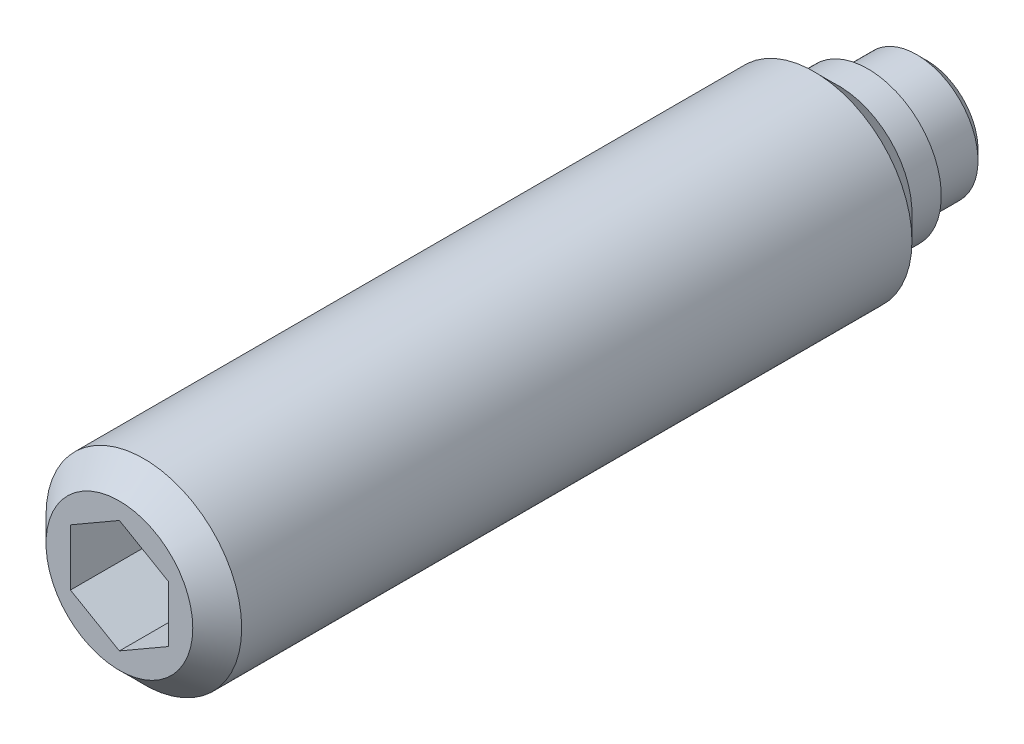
ISO-10303-21;
HEADER;
FILE_DESCRIPTION(('STEP AP214'),'2;1');
FILE_NAME('part.step','',(''),(''),'','','');
FILE_SCHEMA(('AUTOMOTIVE_DESIGN { 1 0 10303 214 1 1 1 1 }'));
ENDSEC;
DATA;
#1=APPLICATION_CONTEXT('core data for automotive mechanical design processes');
#2=APPLICATION_PROTOCOL_DEFINITION('international standard','automotive_design',2000,#1);
#3=PRODUCT_CONTEXT('',#1,'mechanical');
#4=PRODUCT('Part','Part','',(#3));
#5=PRODUCT_RELATED_PRODUCT_CATEGORY('part','',(#4));
#6=PRODUCT_DEFINITION_FORMATION('','',#4);
#7=PRODUCT_DEFINITION_CONTEXT('part definition',#1,'design');
#8=PRODUCT_DEFINITION('design','',#6,#7);
#9=PRODUCT_DEFINITION_SHAPE('','',#8);
#10=(LENGTH_UNIT() NAMED_UNIT(*) SI_UNIT(.MILLI.,.METRE.));
#11=(NAMED_UNIT(*) PLANE_ANGLE_UNIT() SI_UNIT($,.RADIAN.));
#12=(NAMED_UNIT(*) SI_UNIT($,.STERADIAN.) SOLID_ANGLE_UNIT());
#13=UNCERTAINTY_MEASURE_WITH_UNIT(LENGTH_MEASURE(1.E-05),#10,'distance_accuracy_value','');
#14=(GEOMETRIC_REPRESENTATION_CONTEXT(3) GLOBAL_UNCERTAINTY_ASSIGNED_CONTEXT((#13)) GLOBAL_UNIT_ASSIGNED_CONTEXT((#10,
#11,#12)) REPRESENTATION_CONTEXT('',''));
#15=CARTESIAN_POINT('',(0.,0.,0.));
#16=DIRECTION('',(0.,0.,1.));
#17=DIRECTION('',(1.,0.,0.));
#18=AXIS2_PLACEMENT_3D('',#15,#16,#17);
#19=CARTESIAN_POINT('',(0.,0.,1.2));
#20=DIRECTION('',(0.,0.,-1.));
#21=DIRECTION('',(-1.,0.,0.));
#22=AXIS2_PLACEMENT_3D('',#19,#20,#21);
#23=CYLINDRICAL_SURFACE('',#22,2.);
#24=CARTESIAN_POINT('',(0.,0.,2.3));
#25=DIRECTION('',(0.,0.,-1.));
#26=DIRECTION('',(-1.,0.,0.));
#27=AXIS2_PLACEMENT_3D('',#24,#25,#26);
#28=CIRCLE('',#27,2.);
#29=CARTESIAN_POINT('',(-2.,0.,2.3));
#30=VERTEX_POINT('',#29);
#31=EDGE_CURVE('E9',#30,#30,#28,.T.);
#32=ORIENTED_EDGE('',*,*,#31,.F.);
#33=EDGE_LOOP('',(#32));
#34=FACE_BOUND('',#33,.T.);
#35=CARTESIAN_POINT('',(0.,0.,16.));
#36=DIRECTION('',(0.,0.,1.));
#37=DIRECTION('',(1.,0.,0.));
#38=AXIS2_PLACEMENT_3D('',#35,#36,#37);
#39=CIRCLE('',#38,2.);
#40=CARTESIAN_POINT('',(2.,0.,16.));
#41=VERTEX_POINT('',#40);
#42=EDGE_CURVE('E115',#41,#41,#39,.T.);
#43=ORIENTED_EDGE('',*,*,#42,.F.);
#44=EDGE_LOOP('',(#43));
#45=FACE_BOUND('',#44,.T.);
#46=ADVANCED_FACE('F14',(#34,#45),#23,.T.);
#47=CARTESIAN_POINT('',(0.,0.,2.3));
#48=DIRECTION('',(0.,0.,1.));
#49=DIRECTION('',(1.,0.,0.));
#50=AXIS2_PLACEMENT_3D('',#47,#48,#49);
#51=CONICAL_SURFACE('',#50,2.,0.785398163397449);
#52=ORIENTED_EDGE('',*,*,#31,.T.);
#53=EDGE_LOOP('',(#52));
#54=FACE_BOUND('',#53,.T.);
#55=CARTESIAN_POINT('',(0.,0.,1.8));
#56=DIRECTION('',(0.,0.,-1.));
#57=DIRECTION('',(-1.,0.,0.));
#58=AXIS2_PLACEMENT_3D('',#55,#56,#57);
#59=CIRCLE('',#58,1.5);
#60=CARTESIAN_POINT('',(-1.5,0.,1.8));
#61=VERTEX_POINT('',#60);
#62=EDGE_CURVE('E21',#61,#61,#59,.T.);
#63=ORIENTED_EDGE('',*,*,#62,.F.);
#64=EDGE_LOOP('',(#63));
#65=FACE_BOUND('',#64,.T.);
#66=ADVANCED_FACE('F142',(#54,#65),#51,.T.);
#67=CARTESIAN_POINT('',(0.,0.,1.2));
#68=DIRECTION('',(0.,0.,-1.));
#69=DIRECTION('',(-1.,0.,0.));
#70=AXIS2_PLACEMENT_3D('',#67,#68,#69);
#71=CYLINDRICAL_SURFACE('',#70,1.5);
#72=CARTESIAN_POINT('',(0.,0.,1.2));
#73=DIRECTION('',(0.,0.,-1.));
#74=DIRECTION('',(-1.,0.,0.));
#75=AXIS2_PLACEMENT_3D('',#72,#73,#74);
#76=CIRCLE('',#75,1.5);
#77=CARTESIAN_POINT('',(-1.5,0.,1.2));
#78=VERTEX_POINT('',#77);
#79=EDGE_CURVE('E135',#78,#78,#76,.T.);
#80=ORIENTED_EDGE('',*,*,#79,.F.);
#81=EDGE_LOOP('',(#80));
#82=FACE_BOUND('',#81,.T.);
#83=ORIENTED_EDGE('',*,*,#62,.T.);
#84=EDGE_LOOP('',(#83));
#85=FACE_BOUND('',#84,.T.);
#86=ADVANCED_FACE('F140',(#82,#85),#71,.T.);
#87=CARTESIAN_POINT('',(0.,1.5,1.2));
#88=DIRECTION('',(0.,0.,1.));
#89=DIRECTION('',(1.,0.,0.));
#90=AXIS2_PLACEMENT_3D('',#87,#88,#89);
#91=PLANE('',#90);
#92=CARTESIAN_POINT('',(0.,0.,1.2));
#93=DIRECTION('',(0.,0.,-1.));
#94=DIRECTION('',(-1.,0.,0.));
#95=AXIS2_PLACEMENT_3D('',#92,#93,#94);
#96=CIRCLE('',#95,1.25);
#97=CARTESIAN_POINT('',(-1.25,0.,1.2));
#98=VERTEX_POINT('',#97);
#99=EDGE_CURVE('E132',#98,#98,#96,.T.);
#100=ORIENTED_EDGE('',*,*,#99,.F.);
#101=EDGE_LOOP('',(#100));
#102=FACE_BOUND('',#101,.T.);
#103=ORIENTED_EDGE('',*,*,#79,.T.);
#104=EDGE_LOOP('',(#103));
#105=FACE_BOUND('',#104,.T.);
#106=ADVANCED_FACE('F150',(#102,#105),#91,.F.);
#107=CARTESIAN_POINT('',(0.,0.,0.));
#108=DIRECTION('',(0.,0.,-1.));
#109=DIRECTION('',(-1.,0.,0.));
#110=AXIS2_PLACEMENT_3D('',#107,#108,#109);
#111=CYLINDRICAL_SURFACE('',#110,1.25);
#112=CARTESIAN_POINT('',(0.,0.,0.2));
#113=DIRECTION('',(0.,0.,-1.));
#114=DIRECTION('',(-1.,0.,0.));
#115=AXIS2_PLACEMENT_3D('',#112,#113,#114);
#116=CIRCLE('',#115,1.25);
#117=CARTESIAN_POINT('',(-1.25,0.,0.2));
#118=VERTEX_POINT('',#117);
#119=EDGE_CURVE('E129',#118,#118,#116,.T.);
#120=ORIENTED_EDGE('',*,*,#119,.F.);
#121=EDGE_LOOP('',(#120));
#122=FACE_BOUND('',#121,.T.);
#123=ORIENTED_EDGE('',*,*,#99,.T.);
#124=EDGE_LOOP('',(#123));
#125=FACE_BOUND('',#124,.T.);
#126=ADVANCED_FACE('F157',(#122,#125),#111,.T.);
#127=CARTESIAN_POINT('',(0.,0.,0.2));
#128=DIRECTION('',(0.,0.,1.));
#129=DIRECTION('',(1.,0.,0.));
#130=AXIS2_PLACEMENT_3D('',#127,#128,#129);
#131=CONICAL_SURFACE('',#130,1.25,0.785398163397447);
#132=CARTESIAN_POINT('',(0.,0.,0.));
#133=DIRECTION('',(0.,0.,-1.));
#134=DIRECTION('',(-1.,0.,0.));
#135=AXIS2_PLACEMENT_3D('',#132,#133,#134);
#136=CIRCLE('',#135,1.05);
#137=CARTESIAN_POINT('',(-1.05,0.,0.));
#138=VERTEX_POINT('',#137);
#139=EDGE_CURVE('E126',#138,#138,#136,.T.);
#140=ORIENTED_EDGE('',*,*,#139,.F.);
#141=EDGE_LOOP('',(#140));
#142=FACE_BOUND('',#141,.T.);
#143=ORIENTED_EDGE('',*,*,#119,.T.);
#144=EDGE_LOOP('',(#143));
#145=FACE_BOUND('',#144,.T.);
#146=ADVANCED_FACE('F161',(#142,#145),#131,.T.);
#147=CARTESIAN_POINT('',(0.,1.05,0.));
#148=DIRECTION('',(0.,0.,1.));
#149=DIRECTION('',(1.,0.,0.));
#150=AXIS2_PLACEMENT_3D('',#147,#148,#149);
#151=PLANE('',#150);
#152=ORIENTED_EDGE('',*,*,#139,.T.);
#153=EDGE_LOOP('',(#152));
#154=FACE_BOUND('',#153,.T.);
#155=ADVANCED_FACE('F165',(#154),#151,.F.);
#156=CARTESIAN_POINT('',(0.,0.,16.5));
#157=DIRECTION('',(0.,0.,1.));
#158=DIRECTION('',(1.,0.,0.));
#159=AXIS2_PLACEMENT_3D('',#156,#157,#158);
#160=PLANE('',#159);
#161=DIRECTION('',(0.866025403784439,-0.5,0.));
#162=VECTOR('',#161,1.);
#163=CARTESIAN_POINT('',(-1.,-0.577350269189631,16.5));
#164=LINE('',#163,#162);
#165=CARTESIAN_POINT('',(-1.,-0.577350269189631,16.5));
#166=VERTEX_POINT('',#165);
#167=CARTESIAN_POINT('',(0.,-1.15470053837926,16.5));
#168=VERTEX_POINT('',#167);
#169=EDGE_CURVE('E28',#166,#168,#164,.T.);
#170=ORIENTED_EDGE('',*,*,#169,.F.);
#171=DIRECTION('',(0.,-1.,0.));
#172=VECTOR('',#171,1.);
#173=CARTESIAN_POINT('',(-1.,0.577350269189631,16.5));
#174=LINE('',#173,#172);
#175=CARTESIAN_POINT('',(-1.,0.577350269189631,16.5));
#176=VERTEX_POINT('',#175);
#177=EDGE_CURVE('E111',#176,#166,#174,.T.);
#178=ORIENTED_EDGE('',*,*,#177,.F.);
#179=DIRECTION('',(-0.866025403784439,-0.5,0.));
#180=VECTOR('',#179,1.);
#181=CARTESIAN_POINT('',(0.,1.15470053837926,16.5));
#182=LINE('',#181,#180);
#183=CARTESIAN_POINT('',(0.,1.15470053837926,16.5));
#184=VERTEX_POINT('',#183);
#185=EDGE_CURVE('E109',#184,#176,#182,.T.);
#186=ORIENTED_EDGE('',*,*,#185,.F.);
#187=DIRECTION('',(-0.866025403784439,0.5,0.));
#188=VECTOR('',#187,1.);
#189=CARTESIAN_POINT('',(1.,0.577350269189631,16.5));
#190=LINE('',#189,#188);
#191=CARTESIAN_POINT('',(1.,0.577350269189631,16.5));
#192=VERTEX_POINT('',#191);
#193=EDGE_CURVE('E76',#192,#184,#190,.T.);
#194=ORIENTED_EDGE('',*,*,#193,.F.);
#195=DIRECTION('',(0.,1.,0.));
#196=VECTOR('',#195,1.);
#197=CARTESIAN_POINT('',(1.,-0.577350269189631,16.5));
#198=LINE('',#197,#196);
#199=CARTESIAN_POINT('',(1.,-0.577350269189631,16.5));
#200=VERTEX_POINT('',#199);
#201=EDGE_CURVE('E105',#200,#192,#198,.T.);
#202=ORIENTED_EDGE('',*,*,#201,.F.);
#203=DIRECTION('',(0.866025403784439,0.5,0.));
#204=VECTOR('',#203,1.);
#205=CARTESIAN_POINT('',(0.,-1.15470053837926,16.5));
#206=LINE('',#205,#204);
#207=EDGE_CURVE('E102',#168,#200,#206,.T.);
#208=ORIENTED_EDGE('',*,*,#207,.F.);
#209=EDGE_LOOP('',(#170,#178,#186,#194,#202,#208));
#210=FACE_BOUND('',#209,.T.);
#211=CARTESIAN_POINT('',(0.,0.,16.5));
#212=DIRECTION('',(0.,0.,1.));
#213=DIRECTION('',(1.,0.,0.));
#214=AXIS2_PLACEMENT_3D('',#211,#212,#213);
#215=CIRCLE('',#214,1.5);
#216=CARTESIAN_POINT('',(1.5,0.,16.5));
#217=VERTEX_POINT('',#216);
#218=EDGE_CURVE('E123',#217,#217,#215,.T.);
#219=ORIENTED_EDGE('',*,*,#218,.T.);
#220=EDGE_LOOP('',(#219));
#221=FACE_BOUND('',#220,.T.);
#222=ADVANCED_FACE('F169',(#210,#221),#160,.T.);
#223=CARTESIAN_POINT('',(0.,0.,16.5));
#224=DIRECTION('',(0.,0.,-1.));
#225=DIRECTION('',(-1.,0.,0.));
#226=AXIS2_PLACEMENT_3D('',#223,#224,#225);
#227=CONICAL_SURFACE('',#226,1.5,0.785398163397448);
#228=ORIENTED_EDGE('',*,*,#42,.T.);
#229=EDGE_LOOP('',(#228));
#230=FACE_BOUND('',#229,.T.);
#231=ORIENTED_EDGE('',*,*,#218,.F.);
#232=EDGE_LOOP('',(#231));
#233=FACE_BOUND('',#232,.T.);
#234=ADVANCED_FACE('F173',(#230,#233),#227,.T.);
#235=CARTESIAN_POINT('',(-1.,-0.577350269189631,14.));
#236=DIRECTION('',(-0.5,-0.866025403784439,0.));
#237=DIRECTION('',(0.866025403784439,-0.5,0.));
#238=AXIS2_PLACEMENT_3D('',#235,#236,#237);
#239=PLANE('',#238);
#240=ORIENTED_EDGE('',*,*,#169,.T.);
#241=DIRECTION('',(0.,0.,1.));
#242=VECTOR('',#241,1.);
#243=CARTESIAN_POINT('',(0.,-1.15470053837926,14.));
#244=LINE('',#243,#242);
#245=CARTESIAN_POINT('',(0.,-1.15470053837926,14.));
#246=VERTEX_POINT('',#245);
#247=EDGE_CURVE('E58',#246,#168,#244,.T.);
#248=ORIENTED_EDGE('',*,*,#247,.F.);
#249=DIRECTION('',(0.866025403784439,-0.5,0.));
#250=VECTOR('',#249,1.);
#251=CARTESIAN_POINT('',(-1.,-0.577350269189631,14.));
#252=LINE('',#251,#250);
#253=CARTESIAN_POINT('',(-1.,-0.577350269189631,14.));
#254=VERTEX_POINT('',#253);
#255=EDGE_CURVE('E113',#254,#246,#252,.T.);
#256=ORIENTED_EDGE('',*,*,#255,.F.);
#257=DIRECTION('',(0.,0.,1.));
#258=VECTOR('',#257,1.);
#259=CARTESIAN_POINT('',(-1.,-0.577350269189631,14.));
#260=LINE('',#259,#258);
#261=EDGE_CURVE('E36',#254,#166,#260,.T.);
#262=ORIENTED_EDGE('',*,*,#261,.T.);
#263=EDGE_LOOP('',(#240,#248,#256,#262));
#264=FACE_BOUND('',#263,.T.);
#265=ADVANCED_FACE('F177',(#264),#239,.F.);
#266=CARTESIAN_POINT('',(-1.,0.577350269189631,14.));
#267=DIRECTION('',(-1.,0.,0.));
#268=DIRECTION('',(0.,0.,1.));
#269=AXIS2_PLACEMENT_3D('',#266,#267,#268);
#270=PLANE('',#269);
#271=ORIENTED_EDGE('',*,*,#177,.T.);
#272=ORIENTED_EDGE('',*,*,#261,.F.);
#273=DIRECTION('',(0.,-1.,0.));
#274=VECTOR('',#273,1.);
#275=CARTESIAN_POINT('',(-1.,0.577350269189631,14.));
#276=LINE('',#275,#274);
#277=CARTESIAN_POINT('',(-1.,0.577350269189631,14.));
#278=VERTEX_POINT('',#277);
#279=EDGE_CURVE('E88',#278,#254,#276,.T.);
#280=ORIENTED_EDGE('',*,*,#279,.F.);
#281=DIRECTION('',(0.,0.,1.));
#282=VECTOR('',#281,1.);
#283=CARTESIAN_POINT('',(-1.,0.577350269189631,14.));
#284=LINE('',#283,#282);
#285=EDGE_CURVE('E80',#278,#176,#284,.T.);
#286=ORIENTED_EDGE('',*,*,#285,.T.);
#287=EDGE_LOOP('',(#271,#272,#280,#286));
#288=FACE_BOUND('',#287,.T.);
#289=ADVANCED_FACE('F181',(#288),#270,.F.);
#290=CARTESIAN_POINT('',(0.,1.15470053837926,14.));
#291=DIRECTION('',(-0.5,0.866025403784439,0.));
#292=DIRECTION('',(-0.866025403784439,-0.5,0.));
#293=AXIS2_PLACEMENT_3D('',#290,#291,#292);
#294=PLANE('',#293);
#295=ORIENTED_EDGE('',*,*,#185,.T.);
#296=ORIENTED_EDGE('',*,*,#285,.F.);
#297=DIRECTION('',(-0.866025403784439,-0.5,0.));
#298=VECTOR('',#297,1.);
#299=CARTESIAN_POINT('',(0.,1.15470053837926,14.));
#300=LINE('',#299,#298);
#301=CARTESIAN_POINT('',(0.,1.15470053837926,14.));
#302=VERTEX_POINT('',#301);
#303=EDGE_CURVE('E84',#302,#278,#300,.T.);
#304=ORIENTED_EDGE('',*,*,#303,.F.);
#305=DIRECTION('',(0.,0.,1.));
#306=VECTOR('',#305,1.);
#307=CARTESIAN_POINT('',(0.,1.15470053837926,14.));
#308=LINE('',#307,#306);
#309=EDGE_CURVE('E69',#302,#184,#308,.T.);
#310=ORIENTED_EDGE('',*,*,#309,.T.);
#311=EDGE_LOOP('',(#295,#296,#304,#310));
#312=FACE_BOUND('',#311,.T.);
#313=ADVANCED_FACE('F85',(#312),#294,.F.);
#314=CARTESIAN_POINT('',(1.,0.577350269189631,14.));
#315=DIRECTION('',(0.5,0.866025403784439,0.));
#316=DIRECTION('',(-0.866025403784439,0.5,0.));
#317=AXIS2_PLACEMENT_3D('',#314,#315,#316);
#318=PLANE('',#317);
#319=ORIENTED_EDGE('',*,*,#193,.T.);
#320=ORIENTED_EDGE('',*,*,#309,.F.);
#321=DIRECTION('',(-0.866025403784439,0.5,0.));
#322=VECTOR('',#321,1.);
#323=CARTESIAN_POINT('',(1.,0.577350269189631,14.));
#324=LINE('',#323,#322);
#325=CARTESIAN_POINT('',(1.,0.577350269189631,14.));
#326=VERTEX_POINT('',#325);
#327=EDGE_CURVE('E73',#326,#302,#324,.T.);
#328=ORIENTED_EDGE('',*,*,#327,.F.);
#329=DIRECTION('',(0.,0.,1.));
#330=VECTOR('',#329,1.);
#331=CARTESIAN_POINT('',(1.,0.577350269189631,14.));
#332=LINE('',#331,#330);
#333=EDGE_CURVE('E81',#326,#192,#332,.T.);
#334=ORIENTED_EDGE('',*,*,#333,.T.);
#335=EDGE_LOOP('',(#319,#320,#328,#334));
#336=FACE_BOUND('',#335,.T.);
#337=ADVANCED_FACE('F71',(#336),#318,.F.);
#338=CARTESIAN_POINT('',(1.,-0.577350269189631,14.));
#339=DIRECTION('',(1.,0.,0.));
#340=DIRECTION('',(0.,0.,-1.));
#341=AXIS2_PLACEMENT_3D('',#338,#339,#340);
#342=PLANE('',#341);
#343=ORIENTED_EDGE('',*,*,#201,.T.);
#344=ORIENTED_EDGE('',*,*,#333,.F.);
#345=DIRECTION('',(0.,1.,0.));
#346=VECTOR('',#345,1.);
#347=CARTESIAN_POINT('',(1.,-0.577350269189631,14.));
#348=LINE('',#347,#346);
#349=CARTESIAN_POINT('',(1.,-0.577350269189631,14.));
#350=VERTEX_POINT('',#349);
#351=EDGE_CURVE('E94',#350,#326,#348,.T.);
#352=ORIENTED_EDGE('',*,*,#351,.F.);
#353=DIRECTION('',(0.,0.,1.));
#354=VECTOR('',#353,1.);
#355=CARTESIAN_POINT('',(1.,-0.577350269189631,14.));
#356=LINE('',#355,#354);
#357=EDGE_CURVE('E118',#350,#200,#356,.T.);
#358=ORIENTED_EDGE('',*,*,#357,.T.);
#359=EDGE_LOOP('',(#343,#344,#352,#358));
#360=FACE_BOUND('',#359,.T.);
#361=ADVANCED_FACE('F185',(#360),#342,.F.);
#362=CARTESIAN_POINT('',(0.,-1.15470053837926,14.));
#363=DIRECTION('',(0.5,-0.866025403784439,0.));
#364=DIRECTION('',(0.866025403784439,0.5,0.));
#365=AXIS2_PLACEMENT_3D('',#362,#363,#364);
#366=PLANE('',#365);
#367=ORIENTED_EDGE('',*,*,#207,.T.);
#368=ORIENTED_EDGE('',*,*,#357,.F.);
#369=DIRECTION('',(0.866025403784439,0.5,0.));
#370=VECTOR('',#369,1.);
#371=CARTESIAN_POINT('',(0.,-1.15470053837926,14.));
#372=LINE('',#371,#370);
#373=EDGE_CURVE('E96',#246,#350,#372,.T.);
#374=ORIENTED_EDGE('',*,*,#373,.F.);
#375=ORIENTED_EDGE('',*,*,#247,.T.);
#376=EDGE_LOOP('',(#367,#368,#374,#375));
#377=FACE_BOUND('',#376,.T.);
#378=ADVANCED_FACE('F182',(#377),#366,.F.);
#379=CARTESIAN_POINT('',(0.,0.,14.));
#380=DIRECTION('',(0.,0.,1.));
#381=DIRECTION('',(1.,0.,0.));
#382=AXIS2_PLACEMENT_3D('',#379,#380,#381);
#383=PLANE('',#382);
#384=ORIENTED_EDGE('',*,*,#255,.T.);
#385=ORIENTED_EDGE('',*,*,#373,.T.);
#386=ORIENTED_EDGE('',*,*,#351,.T.);
#387=ORIENTED_EDGE('',*,*,#327,.T.);
#388=ORIENTED_EDGE('',*,*,#303,.T.);
#389=ORIENTED_EDGE('',*,*,#279,.T.);
#390=EDGE_LOOP('',(#384,#385,#386,#387,#388,#389));
#391=FACE_BOUND('',#390,.T.);
#392=ADVANCED_FACE('F91',(#391),#383,.T.);
#393=CLOSED_SHELL('',(#46,#66,#86,#106,#126,#146,#155,#222,#234,#265,#289,#313,#337,#361,#378,#392));
#394=MANIFOLD_SOLID_BREP('B1',#393);
#395=ADVANCED_BREP_SHAPE_REPRESENTATION('',(#18,#394),#14);
#396=SHAPE_DEFINITION_REPRESENTATION(#9,#395);
ENDSEC;
END-ISO-10303-21;
